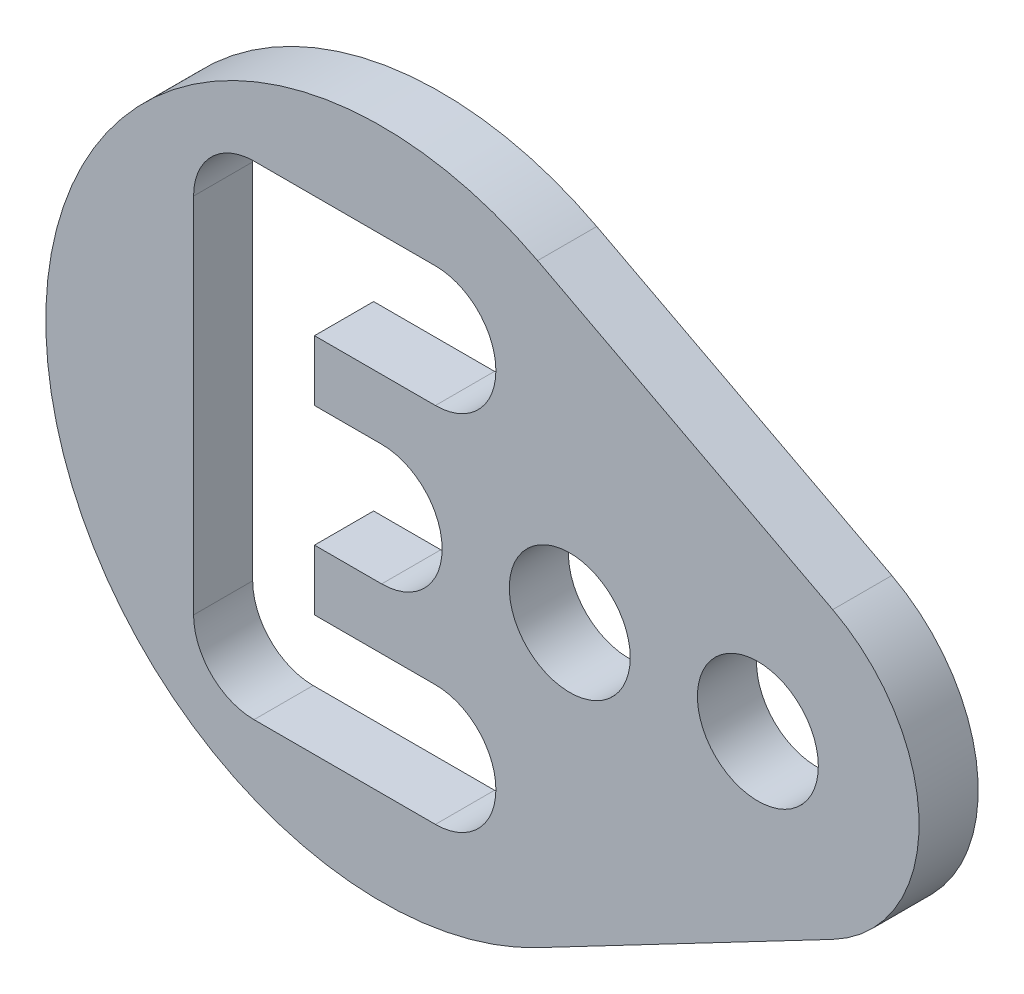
ISO-10303-21;
HEADER;
FILE_DESCRIPTION(('STEP AP214'),'2;1');
FILE_NAME('part.step','',(''),(''),'','','');
FILE_SCHEMA(('AUTOMOTIVE_DESIGN { 1 0 10303 214 1 1 1 1 }'));
ENDSEC;
DATA;
#1=APPLICATION_CONTEXT('core data for automotive mechanical design processes');
#2=APPLICATION_PROTOCOL_DEFINITION('international standard','automotive_design',2000,#1);
#3=PRODUCT_CONTEXT('',#1,'mechanical');
#4=PRODUCT('Part','Part','',(#3));
#5=PRODUCT_RELATED_PRODUCT_CATEGORY('part','',(#4));
#6=PRODUCT_DEFINITION_FORMATION('','',#4);
#7=PRODUCT_DEFINITION_CONTEXT('part definition',#1,'design');
#8=PRODUCT_DEFINITION('design','',#6,#7);
#9=PRODUCT_DEFINITION_SHAPE('','',#8);
#10=(LENGTH_UNIT() NAMED_UNIT(*) SI_UNIT(.MILLI.,.METRE.));
#11=(NAMED_UNIT(*) PLANE_ANGLE_UNIT() SI_UNIT($,.RADIAN.));
#12=(NAMED_UNIT(*) SI_UNIT($,.STERADIAN.) SOLID_ANGLE_UNIT());
#13=UNCERTAINTY_MEASURE_WITH_UNIT(LENGTH_MEASURE(1.E-05),#10,'distance_accuracy_value','');
#14=(GEOMETRIC_REPRESENTATION_CONTEXT(3) GLOBAL_UNCERTAINTY_ASSIGNED_CONTEXT((#13)) GLOBAL_UNIT_ASSIGNED_CONTEXT((#10,
#11,#12)) REPRESENTATION_CONTEXT('',''));
#15=CARTESIAN_POINT('',(0.,0.,0.));
#16=DIRECTION('',(0.,0.,1.));
#17=DIRECTION('',(1.,0.,0.));
#18=AXIS2_PLACEMENT_3D('',#15,#16,#17);
#19=CARTESIAN_POINT('',(7.,9.,2.2));
#20=DIRECTION('',(0.,0.,1.));
#21=DIRECTION('',(1.,0.,0.));
#22=AXIS2_PLACEMENT_3D('',#19,#20,#21);
#23=PLANE('',#22);
#24=CARTESIAN_POINT('',(21.,9.,2.2));
#25=DIRECTION('',(0.,0.,1.));
#26=DIRECTION('',(1.,0.,0.));
#27=AXIS2_PLACEMENT_3D('',#24,#25,#26);
#28=CIRCLE('',#27,2.25);
#29=CARTESIAN_POINT('',(23.25,9.,2.2));
#30=VERTEX_POINT('',#29);
#31=EDGE_CURVE('E207',#30,#30,#28,.T.);
#32=ORIENTED_EDGE('',*,*,#31,.F.);
#33=EDGE_LOOP('',(#32));
#34=FACE_BOUND('',#33,.T.);
#35=CARTESIAN_POINT('',(7.,9.,2.2));
#36=DIRECTION('',(0.,0.,1.));
#37=DIRECTION('',(1.,0.,0.));
#38=AXIS2_PLACEMENT_3D('',#35,#36,#37);
#39=CIRCLE('',#38,12.5);
#40=CARTESIAN_POINT('',(12.8035714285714,20.0710685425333,2.2));
#41=VERTEX_POINT('',#40);
#42=CARTESIAN_POINT('',(12.8035714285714,-2.07106854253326,2.2));
#43=VERTEX_POINT('',#42);
#44=EDGE_CURVE('E267',#41,#43,#39,.T.);
#45=ORIENTED_EDGE('',*,*,#44,.T.);
#46=DIRECTION('',(0.88568548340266,0.464285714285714,0.));
#47=VECTOR('',#46,1.);
#48=CARTESIAN_POINT('',(12.8035714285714,-2.07106854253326,2.2));
#49=LINE('',#48,#47);
#50=CARTESIAN_POINT('',(23.7857142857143,3.68588709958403,2.2));
#51=VERTEX_POINT('',#50);
#52=EDGE_CURVE('E270',#43,#51,#49,.T.);
#53=ORIENTED_EDGE('',*,*,#52,.T.);
#54=CARTESIAN_POINT('',(21.,9.,2.2));
#55=DIRECTION('',(0.,0.,1.));
#56=DIRECTION('',(1.,0.,0.));
#57=AXIS2_PLACEMENT_3D('',#54,#55,#56);
#58=CIRCLE('',#57,6.);
#59=CARTESIAN_POINT('',(23.7857142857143,14.314112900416,2.2));
#60=VERTEX_POINT('',#59);
#61=EDGE_CURVE('E273',#51,#60,#58,.T.);
#62=ORIENTED_EDGE('',*,*,#61,.T.);
#63=DIRECTION('',(-0.885685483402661,0.464285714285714,0.));
#64=VECTOR('',#63,1.);
#65=CARTESIAN_POINT('',(23.7857142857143,14.314112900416,2.2));
#66=LINE('',#65,#64);
#67=EDGE_CURVE('E275',#60,#41,#66,.T.);
#68=ORIENTED_EDGE('',*,*,#67,.T.);
#69=EDGE_LOOP('',(#45,#53,#62,#68));
#70=FACE_BOUND('',#69,.T.);
#71=DIRECTION('',(-1.,0.,0.));
#72=VECTOR('',#71,1.);
#73=CARTESIAN_POINT('',(2.25,18.,2.2));
#74=LINE('',#73,#72);
#75=CARTESIAN_POINT('',(9.,18.,2.2));
#76=VERTEX_POINT('',#75);
#77=CARTESIAN_POINT('',(2.25,18.,2.2));
#78=VERTEX_POINT('',#77);
#79=EDGE_CURVE('E165',#76,#78,#74,.T.);
#80=ORIENTED_EDGE('',*,*,#79,.F.);
#81=CARTESIAN_POINT('',(9.,15.75,2.2));
#82=DIRECTION('',(0.,0.,1.));
#83=DIRECTION('',(-1.,0.,0.));
#84=AXIS2_PLACEMENT_3D('',#81,#82,#83);
#85=CIRCLE('',#84,2.25);
#86=CARTESIAN_POINT('',(9.,13.5,2.2));
#87=VERTEX_POINT('',#86);
#88=EDGE_CURVE('E157',#87,#76,#85,.T.);
#89=ORIENTED_EDGE('',*,*,#88,.F.);
#90=DIRECTION('',(1.,0.,0.));
#91=VECTOR('',#90,1.);
#92=CARTESIAN_POINT('',(9.,13.5,2.2));
#93=LINE('',#92,#91);
#94=CARTESIAN_POINT('',(4.5,13.5,2.2));
#95=VERTEX_POINT('',#94);
#96=EDGE_CURVE('E204',#95,#87,#93,.T.);
#97=ORIENTED_EDGE('',*,*,#96,.F.);
#98=DIRECTION('',(0.,1.,0.));
#99=VECTOR('',#98,1.);
#100=CARTESIAN_POINT('',(4.5,13.5,2.2));
#101=LINE('',#100,#99);
#102=CARTESIAN_POINT('',(4.5,11.25,2.2));
#103=VERTEX_POINT('',#102);
#104=EDGE_CURVE('E202',#103,#95,#101,.T.);
#105=ORIENTED_EDGE('',*,*,#104,.F.);
#106=DIRECTION('',(-1.,0.,0.));
#107=VECTOR('',#106,1.);
#108=CARTESIAN_POINT('',(4.5,11.25,2.2));
#109=LINE('',#108,#107);
#110=CARTESIAN_POINT('',(7.,11.25,2.2));
#111=VERTEX_POINT('',#110);
#112=EDGE_CURVE('E200',#111,#103,#109,.T.);
#113=ORIENTED_EDGE('',*,*,#112,.F.);
#114=CARTESIAN_POINT('',(7.,9.,2.2));
#115=DIRECTION('',(0.,0.,1.));
#116=DIRECTION('',(-1.,0.,0.));
#117=AXIS2_PLACEMENT_3D('',#114,#115,#116);
#118=CIRCLE('',#117,2.25);
#119=CARTESIAN_POINT('',(7.,6.75,2.2));
#120=VERTEX_POINT('',#119);
#121=EDGE_CURVE('E198',#120,#111,#118,.T.);
#122=ORIENTED_EDGE('',*,*,#121,.F.);
#123=DIRECTION('',(1.,0.,0.));
#124=VECTOR('',#123,1.);
#125=CARTESIAN_POINT('',(7.,6.75,2.2));
#126=LINE('',#125,#124);
#127=CARTESIAN_POINT('',(4.5,6.75,2.2));
#128=VERTEX_POINT('',#127);
#129=EDGE_CURVE('E196',#128,#120,#126,.T.);
#130=ORIENTED_EDGE('',*,*,#129,.F.);
#131=DIRECTION('',(0.,1.,0.));
#132=VECTOR('',#131,1.);
#133=CARTESIAN_POINT('',(4.5,6.75,2.2));
#134=LINE('',#133,#132);
#135=CARTESIAN_POINT('',(4.5,4.5,2.2));
#136=VERTEX_POINT('',#135);
#137=EDGE_CURVE('E194',#136,#128,#134,.T.);
#138=ORIENTED_EDGE('',*,*,#137,.F.);
#139=DIRECTION('',(-1.,0.,0.));
#140=VECTOR('',#139,1.);
#141=CARTESIAN_POINT('',(4.5,4.5,2.2));
#142=LINE('',#141,#140);
#143=CARTESIAN_POINT('',(9.,4.5,2.2));
#144=VERTEX_POINT('',#143);
#145=EDGE_CURVE('E192',#144,#136,#142,.T.);
#146=ORIENTED_EDGE('',*,*,#145,.F.);
#147=CARTESIAN_POINT('',(9.,2.25,2.2));
#148=DIRECTION('',(0.,0.,1.));
#149=DIRECTION('',(1.,0.,0.));
#150=AXIS2_PLACEMENT_3D('',#147,#148,#149);
#151=CIRCLE('',#150,2.25);
#152=CARTESIAN_POINT('',(9.,0.,2.2));
#153=VERTEX_POINT('',#152);
#154=EDGE_CURVE('E190',#153,#144,#151,.T.);
#155=ORIENTED_EDGE('',*,*,#154,.F.);
#156=DIRECTION('',(1.,0.,0.));
#157=VECTOR('',#156,1.);
#158=CARTESIAN_POINT('',(2.25,0.,2.2));
#159=LINE('',#158,#157);
#160=CARTESIAN_POINT('',(2.25,0.,2.2));
#161=VERTEX_POINT('',#160);
#162=EDGE_CURVE('E188',#161,#153,#159,.T.);
#163=ORIENTED_EDGE('',*,*,#162,.F.);
#164=CARTESIAN_POINT('',(2.25,2.25,2.2));
#165=DIRECTION('',(0.,0.,1.));
#166=DIRECTION('',(-1.,0.,0.));
#167=AXIS2_PLACEMENT_3D('',#164,#165,#166);
#168=CIRCLE('',#167,2.25);
#169=CARTESIAN_POINT('',(0.,2.25,2.2));
#170=VERTEX_POINT('',#169);
#171=EDGE_CURVE('E186',#170,#161,#168,.T.);
#172=ORIENTED_EDGE('',*,*,#171,.F.);
#173=DIRECTION('',(0.,-1.,0.));
#174=VECTOR('',#173,1.);
#175=CARTESIAN_POINT('',(0.,2.25,2.2));
#176=LINE('',#175,#174);
#177=CARTESIAN_POINT('',(0.,15.75,2.2));
#178=VERTEX_POINT('',#177);
#179=EDGE_CURVE('E181',#178,#170,#176,.T.);
#180=ORIENTED_EDGE('',*,*,#179,.F.);
#181=CARTESIAN_POINT('',(2.25,15.75,2.2));
#182=DIRECTION('',(0.,0.,1.));
#183=DIRECTION('',(-1.,0.,0.));
#184=AXIS2_PLACEMENT_3D('',#181,#182,#183);
#185=CIRCLE('',#184,2.25);
#186=EDGE_CURVE('E179',#78,#178,#185,.T.);
#187=ORIENTED_EDGE('',*,*,#186,.F.);
#188=EDGE_LOOP('',(#80,#89,#97,#105,#113,#122,#130,#138,#146,#155,#163,#172,#180,#187));
#189=FACE_BOUND('',#188,.T.);
#190=CARTESIAN_POINT('',(14.,9.,2.2));
#191=DIRECTION('',(0.,0.,1.));
#192=DIRECTION('',(1.,0.,0.));
#193=AXIS2_PLACEMENT_3D('',#190,#191,#192);
#194=CIRCLE('',#193,2.25);
#195=CARTESIAN_POINT('',(16.25,9.,2.2));
#196=VERTEX_POINT('',#195);
#197=EDGE_CURVE('E397',#196,#196,#194,.T.);
#198=ORIENTED_EDGE('',*,*,#197,.F.);
#199=EDGE_LOOP('',(#198));
#200=FACE_BOUND('',#199,.T.);
#201=ADVANCED_FACE('F32',(#34,#70,#189,#200),#23,.T.);
#202=CARTESIAN_POINT('',(7.,9.,0.));
#203=DIRECTION('',(0.,0.,1.));
#204=DIRECTION('',(1.,0.,0.));
#205=AXIS2_PLACEMENT_3D('',#202,#203,#204);
#206=PLANE('',#205);
#207=CARTESIAN_POINT('',(7.,9.,0.));
#208=DIRECTION('',(0.,0.,1.));
#209=DIRECTION('',(1.,0.,0.));
#210=AXIS2_PLACEMENT_3D('',#207,#208,#209);
#211=CIRCLE('',#210,12.5);
#212=CARTESIAN_POINT('',(12.8035714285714,20.0710685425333,0.));
#213=VERTEX_POINT('',#212);
#214=CARTESIAN_POINT('',(12.8035714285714,-2.07106854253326,0.));
#215=VERTEX_POINT('',#214);
#216=EDGE_CURVE('E173',#213,#215,#211,.T.);
#217=ORIENTED_EDGE('',*,*,#216,.F.);
#218=DIRECTION('',(-0.885685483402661,0.464285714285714,0.));
#219=VECTOR('',#218,1.);
#220=CARTESIAN_POINT('',(23.7857142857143,14.314112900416,0.));
#221=LINE('',#220,#219);
#222=CARTESIAN_POINT('',(23.7857142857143,14.314112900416,0.));
#223=VERTEX_POINT('',#222);
#224=EDGE_CURVE('E271',#223,#213,#221,.T.);
#225=ORIENTED_EDGE('',*,*,#224,.F.);
#226=CARTESIAN_POINT('',(21.,9.,0.));
#227=DIRECTION('',(0.,0.,1.));
#228=DIRECTION('',(1.,0.,0.));
#229=AXIS2_PLACEMENT_3D('',#226,#227,#228);
#230=CIRCLE('',#229,6.);
#231=CARTESIAN_POINT('',(23.7857142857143,3.68588709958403,0.));
#232=VERTEX_POINT('',#231);
#233=EDGE_CURVE('E282',#232,#223,#230,.T.);
#234=ORIENTED_EDGE('',*,*,#233,.F.);
#235=DIRECTION('',(0.88568548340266,0.464285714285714,0.));
#236=VECTOR('',#235,1.);
#237=CARTESIAN_POINT('',(12.8035714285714,-2.07106854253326,0.));
#238=LINE('',#237,#236);
#239=EDGE_CURVE('E280',#215,#232,#238,.T.);
#240=ORIENTED_EDGE('',*,*,#239,.F.);
#241=EDGE_LOOP('',(#217,#225,#234,#240));
#242=FACE_BOUND('',#241,.T.);
#243=CARTESIAN_POINT('',(9.,15.75,0.));
#244=DIRECTION('',(0.,0.,1.));
#245=DIRECTION('',(-1.,0.,0.));
#246=AXIS2_PLACEMENT_3D('',#243,#244,#245);
#247=CIRCLE('',#246,2.25);
#248=CARTESIAN_POINT('',(9.,13.5,0.));
#249=VERTEX_POINT('',#248);
#250=CARTESIAN_POINT('',(9.,18.,0.));
#251=VERTEX_POINT('',#250);
#252=EDGE_CURVE('E55',#249,#251,#247,.T.);
#253=ORIENTED_EDGE('',*,*,#252,.T.);
#254=DIRECTION('',(-1.,0.,0.));
#255=VECTOR('',#254,1.);
#256=CARTESIAN_POINT('',(2.25,18.,0.));
#257=LINE('',#256,#255);
#258=CARTESIAN_POINT('',(2.25,18.,0.));
#259=VERTEX_POINT('',#258);
#260=EDGE_CURVE('E172',#251,#259,#257,.T.);
#261=ORIENTED_EDGE('',*,*,#260,.T.);
#262=CARTESIAN_POINT('',(2.25,15.75,0.));
#263=DIRECTION('',(0.,0.,1.));
#264=DIRECTION('',(-1.,0.,0.));
#265=AXIS2_PLACEMENT_3D('',#262,#263,#264);
#266=CIRCLE('',#265,2.25);
#267=CARTESIAN_POINT('',(0.,15.75,0.));
#268=VERTEX_POINT('',#267);
#269=EDGE_CURVE('E209',#259,#268,#266,.T.);
#270=ORIENTED_EDGE('',*,*,#269,.T.);
#271=DIRECTION('',(0.,-1.,0.));
#272=VECTOR('',#271,1.);
#273=CARTESIAN_POINT('',(0.,2.25,0.));
#274=LINE('',#273,#272);
#275=CARTESIAN_POINT('',(0.,2.25,0.));
#276=VERTEX_POINT('',#275);
#277=EDGE_CURVE('E212',#268,#276,#274,.T.);
#278=ORIENTED_EDGE('',*,*,#277,.T.);
#279=CARTESIAN_POINT('',(2.25,2.25,0.));
#280=DIRECTION('',(0.,0.,1.));
#281=DIRECTION('',(-1.,0.,0.));
#282=AXIS2_PLACEMENT_3D('',#279,#280,#281);
#283=CIRCLE('',#282,2.25);
#284=CARTESIAN_POINT('',(2.25,0.,0.));
#285=VERTEX_POINT('',#284);
#286=EDGE_CURVE('E215',#276,#285,#283,.T.);
#287=ORIENTED_EDGE('',*,*,#286,.T.);
#288=DIRECTION('',(1.,0.,0.));
#289=VECTOR('',#288,1.);
#290=CARTESIAN_POINT('',(2.25,0.,0.));
#291=LINE('',#290,#289);
#292=CARTESIAN_POINT('',(9.,0.,0.));
#293=VERTEX_POINT('',#292);
#294=EDGE_CURVE('E218',#285,#293,#291,.T.);
#295=ORIENTED_EDGE('',*,*,#294,.T.);
#296=CARTESIAN_POINT('',(9.,2.25,0.));
#297=DIRECTION('',(0.,0.,1.));
#298=DIRECTION('',(1.,0.,0.));
#299=AXIS2_PLACEMENT_3D('',#296,#297,#298);
#300=CIRCLE('',#299,2.25);
#301=CARTESIAN_POINT('',(9.,4.5,0.));
#302=VERTEX_POINT('',#301);
#303=EDGE_CURVE('E221',#293,#302,#300,.T.);
#304=ORIENTED_EDGE('',*,*,#303,.T.);
#305=DIRECTION('',(-1.,0.,0.));
#306=VECTOR('',#305,1.);
#307=CARTESIAN_POINT('',(4.5,4.5,0.));
#308=LINE('',#307,#306);
#309=CARTESIAN_POINT('',(4.5,4.5,0.));
#310=VERTEX_POINT('',#309);
#311=EDGE_CURVE('E224',#302,#310,#308,.T.);
#312=ORIENTED_EDGE('',*,*,#311,.T.);
#313=DIRECTION('',(0.,1.,0.));
#314=VECTOR('',#313,1.);
#315=CARTESIAN_POINT('',(4.5,6.75,0.));
#316=LINE('',#315,#314);
#317=CARTESIAN_POINT('',(4.5,6.75,0.));
#318=VERTEX_POINT('',#317);
#319=EDGE_CURVE('E227',#310,#318,#316,.T.);
#320=ORIENTED_EDGE('',*,*,#319,.T.);
#321=DIRECTION('',(1.,0.,0.));
#322=VECTOR('',#321,1.);
#323=CARTESIAN_POINT('',(7.,6.75,0.));
#324=LINE('',#323,#322);
#325=CARTESIAN_POINT('',(7.,6.75,0.));
#326=VERTEX_POINT('',#325);
#327=EDGE_CURVE('E230',#318,#326,#324,.T.);
#328=ORIENTED_EDGE('',*,*,#327,.T.);
#329=CARTESIAN_POINT('',(7.,9.,0.));
#330=DIRECTION('',(0.,0.,1.));
#331=DIRECTION('',(-1.,0.,0.));
#332=AXIS2_PLACEMENT_3D('',#329,#330,#331);
#333=CIRCLE('',#332,2.25);
#334=CARTESIAN_POINT('',(7.,11.25,0.));
#335=VERTEX_POINT('',#334);
#336=EDGE_CURVE('E233',#326,#335,#333,.T.);
#337=ORIENTED_EDGE('',*,*,#336,.T.);
#338=DIRECTION('',(-1.,0.,0.));
#339=VECTOR('',#338,1.);
#340=CARTESIAN_POINT('',(4.5,11.25,0.));
#341=LINE('',#340,#339);
#342=CARTESIAN_POINT('',(4.5,11.25,0.));
#343=VERTEX_POINT('',#342);
#344=EDGE_CURVE('E236',#335,#343,#341,.T.);
#345=ORIENTED_EDGE('',*,*,#344,.T.);
#346=DIRECTION('',(0.,1.,0.));
#347=VECTOR('',#346,1.);
#348=CARTESIAN_POINT('',(4.5,13.5,0.));
#349=LINE('',#348,#347);
#350=CARTESIAN_POINT('',(4.5,13.5,0.));
#351=VERTEX_POINT('',#350);
#352=EDGE_CURVE('E239',#343,#351,#349,.T.);
#353=ORIENTED_EDGE('',*,*,#352,.T.);
#354=DIRECTION('',(1.,0.,0.));
#355=VECTOR('',#354,1.);
#356=CARTESIAN_POINT('',(9.,13.5,0.));
#357=LINE('',#356,#355);
#358=EDGE_CURVE('E166',#351,#249,#357,.T.);
#359=ORIENTED_EDGE('',*,*,#358,.T.);
#360=EDGE_LOOP('',(#253,#261,#270,#278,#287,#295,#304,#312,#320,#328,#337,#345,#353,#359));
#361=FACE_BOUND('',#360,.T.);
#362=CARTESIAN_POINT('',(21.,9.,0.));
#363=DIRECTION('',(0.,0.,1.));
#364=DIRECTION('',(1.,0.,0.));
#365=AXIS2_PLACEMENT_3D('',#362,#363,#364);
#366=CIRCLE('',#365,2.25);
#367=CARTESIAN_POINT('',(23.25,9.,0.));
#368=VERTEX_POINT('',#367);
#369=EDGE_CURVE('E403',#368,#368,#366,.T.);
#370=ORIENTED_EDGE('',*,*,#369,.T.);
#371=EDGE_LOOP('',(#370));
#372=FACE_BOUND('',#371,.T.);
#373=CARTESIAN_POINT('',(14.,9.,0.));
#374=DIRECTION('',(0.,0.,1.));
#375=DIRECTION('',(1.,0.,0.));
#376=AXIS2_PLACEMENT_3D('',#373,#374,#375);
#377=CIRCLE('',#376,2.25);
#378=CARTESIAN_POINT('',(16.25,9.,0.));
#379=VERTEX_POINT('',#378);
#380=EDGE_CURVE('E400',#379,#379,#377,.T.);
#381=ORIENTED_EDGE('',*,*,#380,.T.);
#382=EDGE_LOOP('',(#381));
#383=FACE_BOUND('',#382,.T.);
#384=ADVANCED_FACE('F300',(#242,#361,#372,#383),#206,.F.);
#385=CARTESIAN_POINT('',(7.,9.,2.2));
#386=DIRECTION('',(0.,0.,-1.));
#387=DIRECTION('',(-1.,0.,0.));
#388=AXIS2_PLACEMENT_3D('',#385,#386,#387);
#389=CYLINDRICAL_SURFACE('',#388,12.5);
#390=ORIENTED_EDGE('',*,*,#216,.T.);
#391=DIRECTION('',(0.,0.,-1.));
#392=VECTOR('',#391,1.);
#393=CARTESIAN_POINT('',(12.8035714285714,-2.07106854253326,2.2));
#394=LINE('',#393,#392);
#395=EDGE_CURVE('E11',#43,#215,#394,.T.);
#396=ORIENTED_EDGE('',*,*,#395,.F.);
#397=ORIENTED_EDGE('',*,*,#44,.F.);
#398=DIRECTION('',(0.,0.,-1.));
#399=VECTOR('',#398,1.);
#400=CARTESIAN_POINT('',(12.8035714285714,20.0710685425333,2.2));
#401=LINE('',#400,#399);
#402=EDGE_CURVE('E277',#41,#213,#401,.T.);
#403=ORIENTED_EDGE('',*,*,#402,.T.);
#404=EDGE_LOOP('',(#390,#396,#397,#403));
#405=FACE_BOUND('',#404,.T.);
#406=ADVANCED_FACE('F34',(#405),#389,.T.);
#407=CARTESIAN_POINT('',(12.8035714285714,-2.07106854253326,2.2));
#408=DIRECTION('',(-0.464285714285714,0.88568548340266,0.));
#409=DIRECTION('',(-0.88568548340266,-0.464285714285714,0.));
#410=AXIS2_PLACEMENT_3D('',#407,#408,#409);
#411=PLANE('',#410);
#412=ORIENTED_EDGE('',*,*,#239,.T.);
#413=DIRECTION('',(0.,0.,-1.));
#414=VECTOR('',#413,1.);
#415=CARTESIAN_POINT('',(23.7857142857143,3.68588709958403,2.2));
#416=LINE('',#415,#414);
#417=EDGE_CURVE('E40',#51,#232,#416,.T.);
#418=ORIENTED_EDGE('',*,*,#417,.F.);
#419=ORIENTED_EDGE('',*,*,#52,.F.);
#420=ORIENTED_EDGE('',*,*,#395,.T.);
#421=EDGE_LOOP('',(#412,#418,#419,#420));
#422=FACE_BOUND('',#421,.T.);
#423=ADVANCED_FACE('F310',(#422),#411,.F.);
#424=CARTESIAN_POINT('',(21.,9.,2.2));
#425=DIRECTION('',(0.,0.,-1.));
#426=DIRECTION('',(-1.,0.,0.));
#427=AXIS2_PLACEMENT_3D('',#424,#425,#426);
#428=CYLINDRICAL_SURFACE('',#427,6.);
#429=ORIENTED_EDGE('',*,*,#233,.T.);
#430=DIRECTION('',(0.,0.,-1.));
#431=VECTOR('',#430,1.);
#432=CARTESIAN_POINT('',(23.7857142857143,14.314112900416,2.2));
#433=LINE('',#432,#431);
#434=EDGE_CURVE('E287',#60,#223,#433,.T.);
#435=ORIENTED_EDGE('',*,*,#434,.F.);
#436=ORIENTED_EDGE('',*,*,#61,.F.);
#437=ORIENTED_EDGE('',*,*,#417,.T.);
#438=EDGE_LOOP('',(#429,#435,#436,#437));
#439=FACE_BOUND('',#438,.T.);
#440=ADVANCED_FACE('F294',(#439),#428,.T.);
#441=CARTESIAN_POINT('',(23.7857142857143,14.314112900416,2.2));
#442=DIRECTION('',(-0.464285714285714,-0.885685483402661,0.));
#443=DIRECTION('',(0.885685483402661,-0.464285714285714,0.));
#444=AXIS2_PLACEMENT_3D('',#441,#442,#443);
#445=PLANE('',#444);
#446=ORIENTED_EDGE('',*,*,#224,.T.);
#447=ORIENTED_EDGE('',*,*,#402,.F.);
#448=ORIENTED_EDGE('',*,*,#67,.F.);
#449=ORIENTED_EDGE('',*,*,#434,.T.);
#450=EDGE_LOOP('',(#446,#447,#448,#449));
#451=FACE_BOUND('',#450,.T.);
#452=ADVANCED_FACE('F304',(#451),#445,.F.);
#453=CARTESIAN_POINT('',(9.,15.75,2.2));
#454=DIRECTION('',(0.,0.,-1.));
#455=DIRECTION('',(-1.,0.,0.));
#456=AXIS2_PLACEMENT_3D('',#453,#454,#455);
#457=CYLINDRICAL_SURFACE('',#456,2.25);
#458=ORIENTED_EDGE('',*,*,#252,.F.);
#459=DIRECTION('',(0.,0.,-1.));
#460=VECTOR('',#459,1.);
#461=CARTESIAN_POINT('',(9.,13.5,2.2));
#462=LINE('',#461,#460);
#463=EDGE_CURVE('E161',#87,#249,#462,.T.);
#464=ORIENTED_EDGE('',*,*,#463,.F.);
#465=ORIENTED_EDGE('',*,*,#88,.T.);
#466=DIRECTION('',(0.,0.,-1.));
#467=VECTOR('',#466,1.);
#468=CARTESIAN_POINT('',(9.,18.,2.2));
#469=LINE('',#468,#467);
#470=EDGE_CURVE('E160',#76,#251,#469,.T.);
#471=ORIENTED_EDGE('',*,*,#470,.T.);
#472=EDGE_LOOP('',(#458,#464,#465,#471));
#473=FACE_BOUND('',#472,.T.);
#474=ADVANCED_FACE('F159',(#473),#457,.F.);
#475=CARTESIAN_POINT('',(2.25,18.,2.2));
#476=DIRECTION('',(0.,-1.,0.));
#477=DIRECTION('',(0.,0.,-1.));
#478=AXIS2_PLACEMENT_3D('',#475,#476,#477);
#479=PLANE('',#478);
#480=ORIENTED_EDGE('',*,*,#260,.F.);
#481=ORIENTED_EDGE('',*,*,#470,.F.);
#482=ORIENTED_EDGE('',*,*,#79,.T.);
#483=DIRECTION('',(0.,0.,-1.));
#484=VECTOR('',#483,1.);
#485=CARTESIAN_POINT('',(2.25,18.,2.2));
#486=LINE('',#485,#484);
#487=EDGE_CURVE('E174',#78,#259,#486,.T.);
#488=ORIENTED_EDGE('',*,*,#487,.T.);
#489=EDGE_LOOP('',(#480,#481,#482,#488));
#490=FACE_BOUND('',#489,.T.);
#491=ADVANCED_FACE('F169',(#490),#479,.T.);
#492=CARTESIAN_POINT('',(2.25,15.75,2.2));
#493=DIRECTION('',(0.,0.,-1.));
#494=DIRECTION('',(-1.,0.,0.));
#495=AXIS2_PLACEMENT_3D('',#492,#493,#494);
#496=CYLINDRICAL_SURFACE('',#495,2.25);
#497=ORIENTED_EDGE('',*,*,#269,.F.);
#498=ORIENTED_EDGE('',*,*,#487,.F.);
#499=ORIENTED_EDGE('',*,*,#186,.T.);
#500=DIRECTION('',(0.,0.,-1.));
#501=VECTOR('',#500,1.);
#502=CARTESIAN_POINT('',(0.,15.75,2.2));
#503=LINE('',#502,#501);
#504=EDGE_CURVE('E264',#178,#268,#503,.T.);
#505=ORIENTED_EDGE('',*,*,#504,.T.);
#506=EDGE_LOOP('',(#497,#498,#499,#505));
#507=FACE_BOUND('',#506,.T.);
#508=ADVANCED_FACE('F335',(#507),#496,.F.);
#509=CARTESIAN_POINT('',(0.,2.25,2.2));
#510=DIRECTION('',(1.,0.,0.));
#511=DIRECTION('',(0.,0.,-1.));
#512=AXIS2_PLACEMENT_3D('',#509,#510,#511);
#513=PLANE('',#512);
#514=ORIENTED_EDGE('',*,*,#277,.F.);
#515=ORIENTED_EDGE('',*,*,#504,.F.);
#516=ORIENTED_EDGE('',*,*,#179,.T.);
#517=DIRECTION('',(0.,0.,-1.));
#518=VECTOR('',#517,1.);
#519=CARTESIAN_POINT('',(0.,2.25,2.2));
#520=LINE('',#519,#518);
#521=EDGE_CURVE('E262',#170,#276,#520,.T.);
#522=ORIENTED_EDGE('',*,*,#521,.T.);
#523=EDGE_LOOP('',(#514,#515,#516,#522));
#524=FACE_BOUND('',#523,.T.);
#525=ADVANCED_FACE('F339',(#524),#513,.T.);
#526=CARTESIAN_POINT('',(2.25,2.25,2.2));
#527=DIRECTION('',(0.,0.,-1.));
#528=DIRECTION('',(-1.,0.,0.));
#529=AXIS2_PLACEMENT_3D('',#526,#527,#528);
#530=CYLINDRICAL_SURFACE('',#529,2.25);
#531=ORIENTED_EDGE('',*,*,#286,.F.);
#532=ORIENTED_EDGE('',*,*,#521,.F.);
#533=ORIENTED_EDGE('',*,*,#171,.T.);
#534=DIRECTION('',(0.,0.,-1.));
#535=VECTOR('',#534,1.);
#536=CARTESIAN_POINT('',(2.25,0.,2.2));
#537=LINE('',#536,#535);
#538=EDGE_CURVE('E260',#161,#285,#537,.T.);
#539=ORIENTED_EDGE('',*,*,#538,.T.);
#540=EDGE_LOOP('',(#531,#532,#533,#539));
#541=FACE_BOUND('',#540,.T.);
#542=ADVANCED_FACE('F345',(#541),#530,.F.);
#543=CARTESIAN_POINT('',(2.25,0.,2.2));
#544=DIRECTION('',(0.,1.,0.));
#545=DIRECTION('',(0.,0.,1.));
#546=AXIS2_PLACEMENT_3D('',#543,#544,#545);
#547=PLANE('',#546);
#548=ORIENTED_EDGE('',*,*,#294,.F.);
#549=ORIENTED_EDGE('',*,*,#538,.F.);
#550=ORIENTED_EDGE('',*,*,#162,.T.);
#551=DIRECTION('',(0.,0.,-1.));
#552=VECTOR('',#551,1.);
#553=CARTESIAN_POINT('',(9.,0.,2.2));
#554=LINE('',#553,#552);
#555=EDGE_CURVE('E258',#153,#293,#554,.T.);
#556=ORIENTED_EDGE('',*,*,#555,.T.);
#557=EDGE_LOOP('',(#548,#549,#550,#556));
#558=FACE_BOUND('',#557,.T.);
#559=ADVANCED_FACE('F349',(#558),#547,.T.);
#560=CARTESIAN_POINT('',(9.,2.25,2.2));
#561=DIRECTION('',(0.,0.,-1.));
#562=DIRECTION('',(-1.,0.,0.));
#563=AXIS2_PLACEMENT_3D('',#560,#561,#562);
#564=CYLINDRICAL_SURFACE('',#563,2.25);
#565=ORIENTED_EDGE('',*,*,#303,.F.);
#566=ORIENTED_EDGE('',*,*,#555,.F.);
#567=ORIENTED_EDGE('',*,*,#154,.T.);
#568=DIRECTION('',(0.,0.,-1.));
#569=VECTOR('',#568,1.);
#570=CARTESIAN_POINT('',(9.,4.5,2.2));
#571=LINE('',#570,#569);
#572=EDGE_CURVE('E256',#144,#302,#571,.T.);
#573=ORIENTED_EDGE('',*,*,#572,.T.);
#574=EDGE_LOOP('',(#565,#566,#567,#573));
#575=FACE_BOUND('',#574,.T.);
#576=ADVANCED_FACE('F353',(#575),#564,.F.);
#577=CARTESIAN_POINT('',(4.5,4.5,2.2));
#578=DIRECTION('',(0.,-1.,0.));
#579=DIRECTION('',(0.,0.,-1.));
#580=AXIS2_PLACEMENT_3D('',#577,#578,#579);
#581=PLANE('',#580);
#582=ORIENTED_EDGE('',*,*,#311,.F.);
#583=ORIENTED_EDGE('',*,*,#572,.F.);
#584=ORIENTED_EDGE('',*,*,#145,.T.);
#585=DIRECTION('',(0.,0.,-1.));
#586=VECTOR('',#585,1.);
#587=CARTESIAN_POINT('',(4.5,4.5,2.2));
#588=LINE('',#587,#586);
#589=EDGE_CURVE('E254',#136,#310,#588,.T.);
#590=ORIENTED_EDGE('',*,*,#589,.T.);
#591=EDGE_LOOP('',(#582,#583,#584,#590));
#592=FACE_BOUND('',#591,.T.);
#593=ADVANCED_FACE('F357',(#592),#581,.T.);
#594=CARTESIAN_POINT('',(4.5,6.75,2.2));
#595=DIRECTION('',(-1.,0.,0.));
#596=DIRECTION('',(0.,0.,1.));
#597=AXIS2_PLACEMENT_3D('',#594,#595,#596);
#598=PLANE('',#597);
#599=ORIENTED_EDGE('',*,*,#319,.F.);
#600=ORIENTED_EDGE('',*,*,#589,.F.);
#601=ORIENTED_EDGE('',*,*,#137,.T.);
#602=DIRECTION('',(0.,0.,-1.));
#603=VECTOR('',#602,1.);
#604=CARTESIAN_POINT('',(4.5,6.75,2.2));
#605=LINE('',#604,#603);
#606=EDGE_CURVE('E252',#128,#318,#605,.T.);
#607=ORIENTED_EDGE('',*,*,#606,.T.);
#608=EDGE_LOOP('',(#599,#600,#601,#607));
#609=FACE_BOUND('',#608,.T.);
#610=ADVANCED_FACE('F361',(#609),#598,.T.);
#611=CARTESIAN_POINT('',(7.,6.75,2.2));
#612=DIRECTION('',(0.,1.,0.));
#613=DIRECTION('',(0.,0.,1.));
#614=AXIS2_PLACEMENT_3D('',#611,#612,#613);
#615=PLANE('',#614);
#616=ORIENTED_EDGE('',*,*,#327,.F.);
#617=ORIENTED_EDGE('',*,*,#606,.F.);
#618=ORIENTED_EDGE('',*,*,#129,.T.);
#619=DIRECTION('',(0.,0.,-1.));
#620=VECTOR('',#619,1.);
#621=CARTESIAN_POINT('',(7.,6.75,2.2));
#622=LINE('',#621,#620);
#623=EDGE_CURVE('E250',#120,#326,#622,.T.);
#624=ORIENTED_EDGE('',*,*,#623,.T.);
#625=EDGE_LOOP('',(#616,#617,#618,#624));
#626=FACE_BOUND('',#625,.T.);
#627=ADVANCED_FACE('F365',(#626),#615,.T.);
#628=CARTESIAN_POINT('',(7.,9.,2.2));
#629=DIRECTION('',(0.,0.,-1.));
#630=DIRECTION('',(-1.,0.,0.));
#631=AXIS2_PLACEMENT_3D('',#628,#629,#630);
#632=CYLINDRICAL_SURFACE('',#631,2.25);
#633=ORIENTED_EDGE('',*,*,#336,.F.);
#634=ORIENTED_EDGE('',*,*,#623,.F.);
#635=ORIENTED_EDGE('',*,*,#121,.T.);
#636=DIRECTION('',(0.,0.,-1.));
#637=VECTOR('',#636,1.);
#638=CARTESIAN_POINT('',(7.,11.25,2.2));
#639=LINE('',#638,#637);
#640=EDGE_CURVE('E248',#111,#335,#639,.T.);
#641=ORIENTED_EDGE('',*,*,#640,.T.);
#642=EDGE_LOOP('',(#633,#634,#635,#641));
#643=FACE_BOUND('',#642,.T.);
#644=ADVANCED_FACE('F369',(#643),#632,.F.);
#645=CARTESIAN_POINT('',(4.5,11.25,2.2));
#646=DIRECTION('',(0.,-1.,0.));
#647=DIRECTION('',(1.,0.,0.));
#648=AXIS2_PLACEMENT_3D('',#645,#646,#647);
#649=PLANE('',#648);
#650=ORIENTED_EDGE('',*,*,#344,.F.);
#651=ORIENTED_EDGE('',*,*,#640,.F.);
#652=ORIENTED_EDGE('',*,*,#112,.T.);
#653=DIRECTION('',(0.,0.,-1.));
#654=VECTOR('',#653,1.);
#655=CARTESIAN_POINT('',(4.5,11.25,2.2));
#656=LINE('',#655,#654);
#657=EDGE_CURVE('E246',#103,#343,#656,.T.);
#658=ORIENTED_EDGE('',*,*,#657,.T.);
#659=EDGE_LOOP('',(#650,#651,#652,#658));
#660=FACE_BOUND('',#659,.T.);
#661=ADVANCED_FACE('F373',(#660),#649,.T.);
#662=CARTESIAN_POINT('',(4.5,13.5,2.2));
#663=DIRECTION('',(-1.,0.,0.));
#664=DIRECTION('',(0.,0.,1.));
#665=AXIS2_PLACEMENT_3D('',#662,#663,#664);
#666=PLANE('',#665);
#667=ORIENTED_EDGE('',*,*,#352,.F.);
#668=ORIENTED_EDGE('',*,*,#657,.F.);
#669=ORIENTED_EDGE('',*,*,#104,.T.);
#670=DIRECTION('',(0.,0.,-1.));
#671=VECTOR('',#670,1.);
#672=CARTESIAN_POINT('',(4.5,13.5,2.2));
#673=LINE('',#672,#671);
#674=EDGE_CURVE('E47',#95,#351,#673,.T.);
#675=ORIENTED_EDGE('',*,*,#674,.T.);
#676=EDGE_LOOP('',(#667,#668,#669,#675));
#677=FACE_BOUND('',#676,.T.);
#678=ADVANCED_FACE('F377',(#677),#666,.T.);
#679=CARTESIAN_POINT('',(9.,13.5,2.2));
#680=DIRECTION('',(0.,1.,0.));
#681=DIRECTION('',(0.,0.,1.));
#682=AXIS2_PLACEMENT_3D('',#679,#680,#681);
#683=PLANE('',#682);
#684=ORIENTED_EDGE('',*,*,#358,.F.);
#685=ORIENTED_EDGE('',*,*,#674,.F.);
#686=ORIENTED_EDGE('',*,*,#96,.T.);
#687=ORIENTED_EDGE('',*,*,#463,.T.);
#688=EDGE_LOOP('',(#684,#685,#686,#687));
#689=FACE_BOUND('',#688,.T.);
#690=ADVANCED_FACE('F381',(#689),#683,.T.);
#691=CARTESIAN_POINT('',(21.,9.,2.2));
#692=DIRECTION('',(0.,0.,-1.));
#693=DIRECTION('',(-1.,0.,0.));
#694=AXIS2_PLACEMENT_3D('',#691,#692,#693);
#695=CYLINDRICAL_SURFACE('',#694,2.25);
#696=ORIENTED_EDGE('',*,*,#31,.T.);
#697=EDGE_LOOP('',(#696));
#698=FACE_BOUND('',#697,.T.);
#699=ORIENTED_EDGE('',*,*,#369,.F.);
#700=EDGE_LOOP('',(#699));
#701=FACE_BOUND('',#700,.T.);
#702=ADVANCED_FACE('F385',(#698,#701),#695,.F.);
#703=CARTESIAN_POINT('',(14.,9.,2.2));
#704=DIRECTION('',(0.,0.,-1.));
#705=DIRECTION('',(-1.,0.,0.));
#706=AXIS2_PLACEMENT_3D('',#703,#704,#705);
#707=CYLINDRICAL_SURFACE('',#706,2.25);
#708=ORIENTED_EDGE('',*,*,#197,.T.);
#709=EDGE_LOOP('',(#708));
#710=FACE_BOUND('',#709,.T.);
#711=ORIENTED_EDGE('',*,*,#380,.F.);
#712=EDGE_LOOP('',(#711));
#713=FACE_BOUND('',#712,.T.);
#714=ADVANCED_FACE('F388',(#710,#713),#707,.F.);
#715=CLOSED_SHELL('',(#201,#384,#406,#423,#440,#452,#474,#491,#508,#525,#542,#559,#576,#593,
#610,#627,#644,#661,#678,#690,#702,#714));
#716=MANIFOLD_SOLID_BREP('B2',#715);
#717=ADVANCED_BREP_SHAPE_REPRESENTATION('',(#18,#716),#14);
#718=SHAPE_DEFINITION_REPRESENTATION(#9,#717);
ENDSEC;
END-ISO-10303-21;
